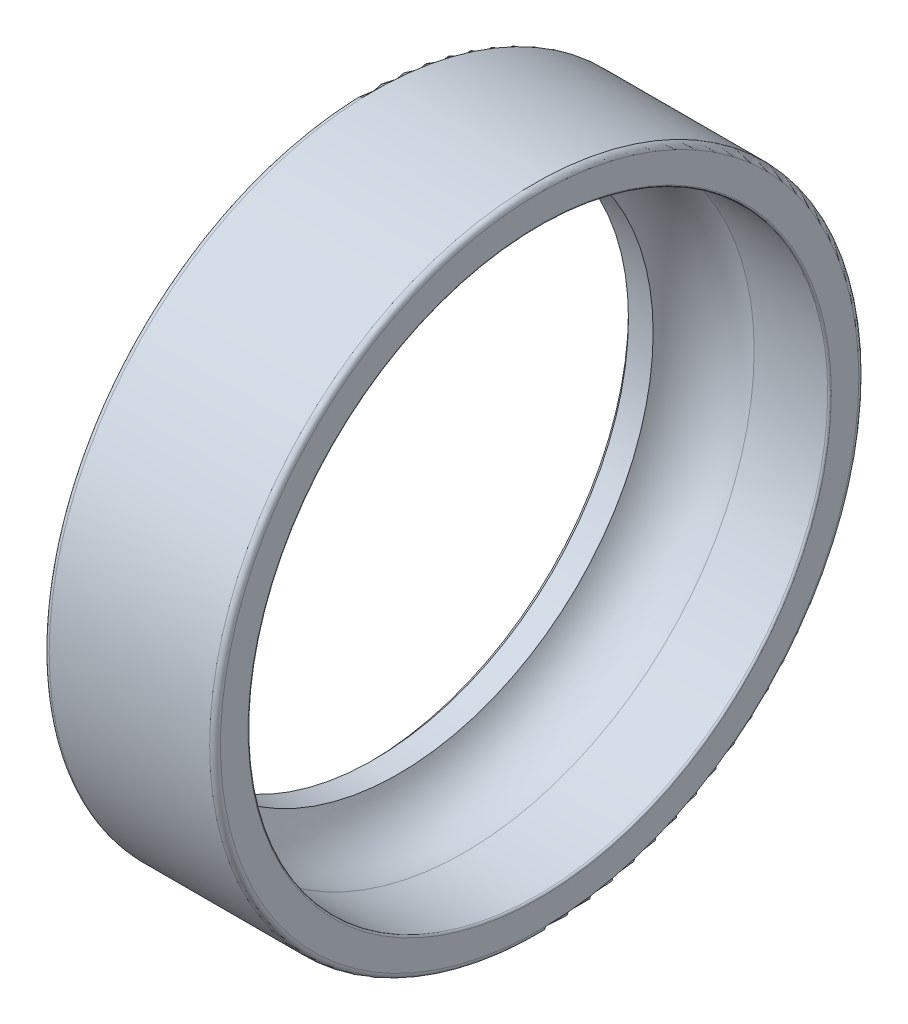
from build123d import *


with BuildPart() as part:
    # Croquis1 → Revoluci_n1 (revolve)
    with BuildSketch(Plane.XY, mode=Mode.PRIVATE) as revoluci_n1_sk:
        with BuildLine():
            Line((0, 35.4), (0, 28.85))
            Line((0, 28.85), (0.6, 28.25))
            Line((0.6, 28.25), (3.338871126, 28.25))
            ThreePointArc((3.338871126, 28.25), (6.321079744, 31.451174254), (10.639960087, 32.15))
            Line((10.639960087, 32.15), (18.8, 32.15))
            ThreePointArc((18.8, 32.15), (18.941421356, 32.208578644), (19, 32.35))
            Line((19, 32.35), (19, 35.4))
            ThreePointArc((19, 35.4), (18.824264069, 35.824264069), (18.4, 36))
            Line((18.4, 36), (0.6, 36))
            ThreePointArc((0.6, 36), (0.175735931, 35.824264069), (0, 35.4))
        make_face()
    revolve(revoluci_n1_sk.sketch.rotate(Axis((19, 0, 0), (-1, 0, 0)), 90), axis=Axis((19, 0, 0), (-1, 0, 0)))


solid = part.part
